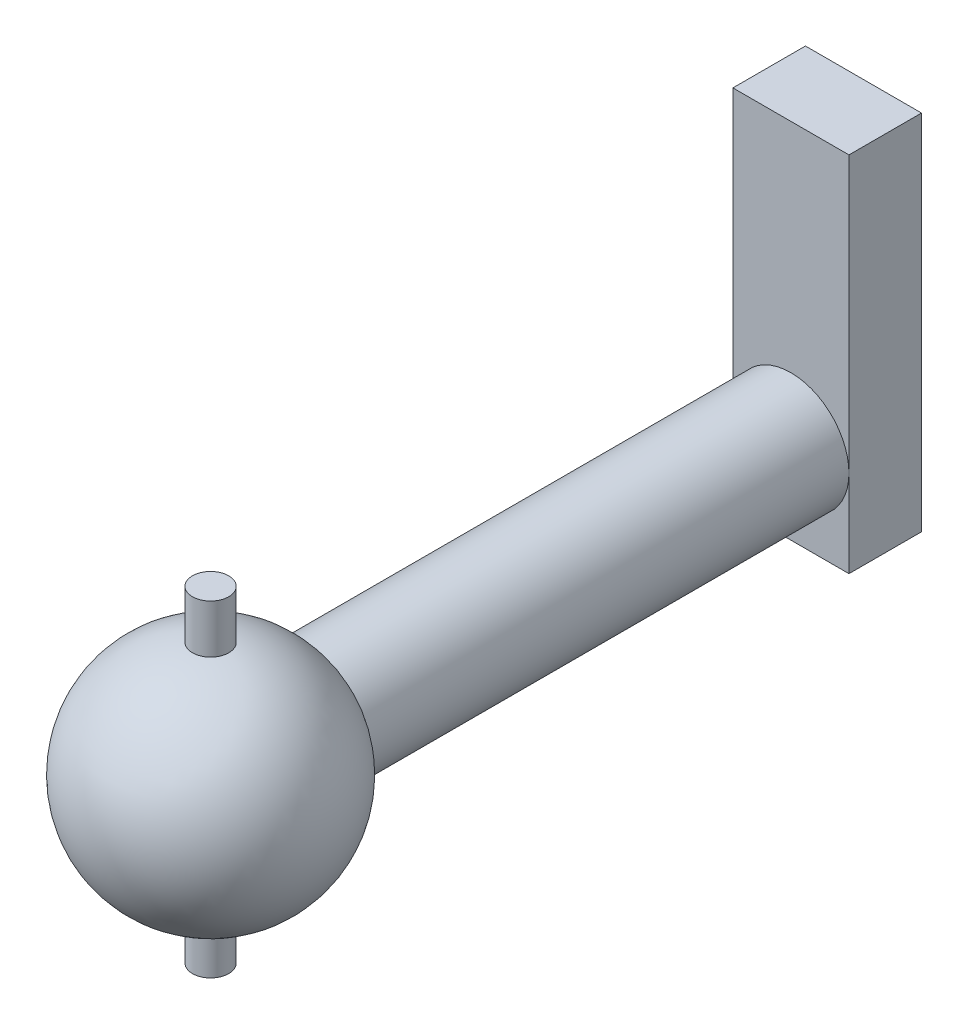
ISO-10303-21;
HEADER;
FILE_DESCRIPTION(('STEP AP214'),'2;1');
FILE_NAME('part.step','',(''),(''),'','','');
FILE_SCHEMA(('AUTOMOTIVE_DESIGN { 1 0 10303 214 1 1 1 1 }'));
ENDSEC;
DATA;
#1=APPLICATION_CONTEXT('core data for automotive mechanical design processes');
#2=APPLICATION_PROTOCOL_DEFINITION('international standard','automotive_design',2000,#1);
#3=PRODUCT_CONTEXT('',#1,'mechanical');
#4=PRODUCT('Part','Part','',(#3));
#5=PRODUCT_RELATED_PRODUCT_CATEGORY('part','',(#4));
#6=PRODUCT_DEFINITION_FORMATION('','',#4);
#7=PRODUCT_DEFINITION_CONTEXT('part definition',#1,'design');
#8=PRODUCT_DEFINITION('design','',#6,#7);
#9=PRODUCT_DEFINITION_SHAPE('','',#8);
#10=(LENGTH_UNIT() NAMED_UNIT(*) SI_UNIT(.MILLI.,.METRE.));
#11=(NAMED_UNIT(*) PLANE_ANGLE_UNIT() SI_UNIT($,.RADIAN.));
#12=(NAMED_UNIT(*) SI_UNIT($,.STERADIAN.) SOLID_ANGLE_UNIT());
#13=UNCERTAINTY_MEASURE_WITH_UNIT(LENGTH_MEASURE(1.E-05),#10,'distance_accuracy_value','');
#14=(GEOMETRIC_REPRESENTATION_CONTEXT(3) GLOBAL_UNCERTAINTY_ASSIGNED_CONTEXT((#13)) GLOBAL_UNIT_ASSIGNED_CONTEXT((#10,
#11,#12)) REPRESENTATION_CONTEXT('',''));
#15=CARTESIAN_POINT('',(0.,0.,0.));
#16=DIRECTION('',(0.,0.,1.));
#17=DIRECTION('',(1.,0.,0.));
#18=AXIS2_PLACEMENT_3D('',#15,#16,#17);
#19=CARTESIAN_POINT('',(0.,0.,80.));
#20=DIRECTION('',(0.,1.,0.));
#21=DIRECTION('',(1.,0.,0.));
#22=AXIS2_PLACEMENT_3D('',#19,#20,#21);
#23=SPHERICAL_SURFACE('',#22,16.);
#24=CARTESIAN_POINT('',(0.,15.8034806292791,80.));
#25=DIRECTION('',(0.,-1.,0.));
#26=DIRECTION('',(0.,0.,-1.));
#27=AXIS2_PLACEMENT_3D('',#24,#25,#26);
#28=CIRCLE('',#27,2.5);
#29=CARTESIAN_POINT('',(0.,15.8034806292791,77.5));
#30=VERTEX_POINT('',#29);
#31=EDGE_CURVE('E41',#30,#30,#28,.F.);
#32=ORIENTED_EDGE('',*,*,#31,.F.);
#33=EDGE_LOOP('',(#32));
#34=FACE_BOUND('',#33,.T.);
#35=CARTESIAN_POINT('',(0.,0.,66.143593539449));
#36=DIRECTION('',(0.,0.,1.));
#37=DIRECTION('',(1.,0.,0.));
#38=AXIS2_PLACEMENT_3D('',#35,#36,#37);
#39=CIRCLE('',#38,8.);
#40=CARTESIAN_POINT('',(8.,0.,66.143593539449));
#41=VERTEX_POINT('',#40);
#42=EDGE_CURVE('E112',#41,#41,#39,.T.);
#43=ORIENTED_EDGE('',*,*,#42,.T.);
#44=EDGE_LOOP('',(#43));
#45=FACE_BOUND('',#44,.T.);
#46=CARTESIAN_POINT('',(0.,-15.8034806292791,80.));
#47=DIRECTION('',(0.,1.,0.));
#48=DIRECTION('',(0.,0.,1.));
#49=AXIS2_PLACEMENT_3D('',#46,#47,#48);
#50=CIRCLE('',#49,2.5);
#51=CARTESIAN_POINT('',(0.,-15.8034806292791,77.5));
#52=VERTEX_POINT('',#51);
#53=EDGE_CURVE('E11',#52,#52,#50,.F.);
#54=ORIENTED_EDGE('',*,*,#53,.F.);
#55=EDGE_LOOP('',(#54));
#56=FACE_BOUND('',#55,.T.);
#57=ADVANCED_FACE('F33',(#34,#45,#56),#23,.T.);
#58=CARTESIAN_POINT('',(0.,0.,80.));
#59=DIRECTION('',(0.,0.,-1.));
#60=DIRECTION('',(-1.,0.,0.));
#61=AXIS2_PLACEMENT_3D('',#58,#59,#60);
#62=CYLINDRICAL_SURFACE('',#61,8.);
#63=CARTESIAN_POINT('',(0.,0.,0.));
#64=DIRECTION('',(0.,0.,1.));
#65=DIRECTION('',(1.,0.,0.));
#66=AXIS2_PLACEMENT_3D('',#63,#64,#65);
#67=CIRCLE('',#66,8.);
#68=CARTESIAN_POINT('',(8.,0.,0.));
#69=VERTEX_POINT('',#68);
#70=CARTESIAN_POINT('',(-8.,0.,0.));
#71=VERTEX_POINT('',#70);
#72=EDGE_CURVE('E105',#69,#71,#67,.T.);
#73=ORIENTED_EDGE('',*,*,#72,.T.);
#74=EDGE_CURVE('E55',#71,#69,#67,.T.);
#75=ORIENTED_EDGE('',*,*,#74,.T.);
#76=EDGE_LOOP('',(#73,#75));
#77=FACE_BOUND('',#76,.T.);
#78=ORIENTED_EDGE('',*,*,#42,.F.);
#79=EDGE_LOOP('',(#78));
#80=FACE_BOUND('',#79,.T.);
#81=ADVANCED_FACE('F35',(#77,#80),#62,.T.);
#82=CARTESIAN_POINT('',(8.,38.,0.));
#83=DIRECTION('',(0.,0.,1.));
#84=DIRECTION('',(1.,0.,0.));
#85=AXIS2_PLACEMENT_3D('',#82,#83,#84);
#86=PLANE('',#85);
#87=ORIENTED_EDGE('',*,*,#72,.F.);
#88=DIRECTION('',(0.,-1.,0.));
#89=VECTOR('',#88,1.);
#90=CARTESIAN_POINT('',(8.,-12.,0.));
#91=LINE('',#90,#89);
#92=CARTESIAN_POINT('',(8.,38.,0.));
#93=VERTEX_POINT('',#92);
#94=EDGE_CURVE('E48',#93,#69,#91,.T.);
#95=ORIENTED_EDGE('',*,*,#94,.F.);
#96=DIRECTION('',(1.,0.,0.));
#97=VECTOR('',#96,1.);
#98=CARTESIAN_POINT('',(8.,38.,0.));
#99=LINE('',#98,#97);
#100=CARTESIAN_POINT('',(-8.,38.,0.));
#101=VERTEX_POINT('',#100);
#102=EDGE_CURVE('E99',#101,#93,#99,.T.);
#103=ORIENTED_EDGE('',*,*,#102,.F.);
#104=DIRECTION('',(0.,1.,0.));
#105=VECTOR('',#104,1.);
#106=CARTESIAN_POINT('',(-8.,-12.,0.));
#107=LINE('',#106,#105);
#108=EDGE_CURVE('E225',#71,#101,#107,.T.);
#109=ORIENTED_EDGE('',*,*,#108,.F.);
#110=EDGE_LOOP('',(#87,#95,#103,#109));
#111=FACE_BOUND('',#110,.T.);
#112=ADVANCED_FACE('F145',(#111),#86,.T.);
#113=ORIENTED_EDGE('',*,*,#74,.F.);
#114=CARTESIAN_POINT('',(-8.,-12.,0.));
#115=VERTEX_POINT('',#114);
#116=EDGE_CURVE('E226',#115,#71,#107,.T.);
#117=ORIENTED_EDGE('',*,*,#116,.F.);
#118=DIRECTION('',(-1.,0.,0.));
#119=VECTOR('',#118,1.);
#120=CARTESIAN_POINT('',(8.,-12.,0.));
#121=LINE('',#120,#119);
#122=CARTESIAN_POINT('',(8.,-12.,0.));
#123=VERTEX_POINT('',#122);
#124=EDGE_CURVE('E223',#123,#115,#121,.T.);
#125=ORIENTED_EDGE('',*,*,#124,.F.);
#126=EDGE_CURVE('E102',#69,#123,#91,.T.);
#127=ORIENTED_EDGE('',*,*,#126,.F.);
#128=EDGE_LOOP('',(#113,#117,#125,#127));
#129=FACE_BOUND('',#128,.T.);
#130=ADVANCED_FACE('F148',(#129),#86,.T.);
#131=CARTESIAN_POINT('',(8.,-12.,-10.));
#132=DIRECTION('',(-1.,0.,0.));
#133=DIRECTION('',(0.,0.,1.));
#134=AXIS2_PLACEMENT_3D('',#131,#132,#133);
#135=PLANE('',#134);
#136=ORIENTED_EDGE('',*,*,#94,.T.);
#137=ORIENTED_EDGE('',*,*,#126,.T.);
#138=DIRECTION('',(0.,0.,1.));
#139=VECTOR('',#138,1.);
#140=CARTESIAN_POINT('',(8.,-12.,-10.));
#141=LINE('',#140,#139);
#142=CARTESIAN_POINT('',(8.,-12.,-10.));
#143=VERTEX_POINT('',#142);
#144=EDGE_CURVE('E86',#143,#123,#141,.T.);
#145=ORIENTED_EDGE('',*,*,#144,.F.);
#146=DIRECTION('',(0.,-1.,0.));
#147=VECTOR('',#146,1.);
#148=CARTESIAN_POINT('',(8.,-12.,-10.));
#149=LINE('',#148,#147);
#150=CARTESIAN_POINT('',(8.,38.,-10.));
#151=VERTEX_POINT('',#150);
#152=EDGE_CURVE('E92',#151,#143,#149,.T.);
#153=ORIENTED_EDGE('',*,*,#152,.F.);
#154=DIRECTION('',(0.,0.,1.));
#155=VECTOR('',#154,1.);
#156=CARTESIAN_POINT('',(8.,38.,-10.));
#157=LINE('',#156,#155);
#158=EDGE_CURVE('E221',#151,#93,#157,.T.);
#159=ORIENTED_EDGE('',*,*,#158,.T.);
#160=EDGE_LOOP('',(#136,#137,#145,#153,#159));
#161=FACE_BOUND('',#160,.T.);
#162=ADVANCED_FACE('F101',(#161),#135,.F.);
#163=CARTESIAN_POINT('',(8.,-12.,-10.));
#164=DIRECTION('',(0.,1.,0.));
#165=DIRECTION('',(0.,0.,1.));
#166=AXIS2_PLACEMENT_3D('',#163,#164,#165);
#167=PLANE('',#166);
#168=ORIENTED_EDGE('',*,*,#124,.T.);
#169=DIRECTION('',(0.,0.,1.));
#170=VECTOR('',#169,1.);
#171=CARTESIAN_POINT('',(-8.,-12.,-10.));
#172=LINE('',#171,#170);
#173=CARTESIAN_POINT('',(-8.,-12.,-10.));
#174=VERTEX_POINT('',#173);
#175=EDGE_CURVE('E88',#174,#115,#172,.T.);
#176=ORIENTED_EDGE('',*,*,#175,.F.);
#177=DIRECTION('',(-1.,0.,0.));
#178=VECTOR('',#177,1.);
#179=CARTESIAN_POINT('',(8.,-12.,-10.));
#180=LINE('',#179,#178);
#181=EDGE_CURVE('E82',#143,#174,#180,.T.);
#182=ORIENTED_EDGE('',*,*,#181,.F.);
#183=ORIENTED_EDGE('',*,*,#144,.T.);
#184=EDGE_LOOP('',(#168,#176,#182,#183));
#185=FACE_BOUND('',#184,.T.);
#186=ADVANCED_FACE('F84',(#185),#167,.F.);
#187=CARTESIAN_POINT('',(-8.,-12.,-10.));
#188=DIRECTION('',(1.,0.,0.));
#189=DIRECTION('',(0.,0.,-1.));
#190=AXIS2_PLACEMENT_3D('',#187,#188,#189);
#191=PLANE('',#190);
#192=ORIENTED_EDGE('',*,*,#116,.T.);
#193=ORIENTED_EDGE('',*,*,#108,.T.);
#194=DIRECTION('',(0.,0.,1.));
#195=VECTOR('',#194,1.);
#196=CARTESIAN_POINT('',(-8.,38.,-10.));
#197=LINE('',#196,#195);
#198=CARTESIAN_POINT('',(-8.,38.,-10.));
#199=VERTEX_POINT('',#198);
#200=EDGE_CURVE('E107',#199,#101,#197,.T.);
#201=ORIENTED_EDGE('',*,*,#200,.F.);
#202=DIRECTION('',(0.,1.,0.));
#203=VECTOR('',#202,1.);
#204=CARTESIAN_POINT('',(-8.,-12.,-10.));
#205=LINE('',#204,#203);
#206=EDGE_CURVE('E91',#174,#199,#205,.T.);
#207=ORIENTED_EDGE('',*,*,#206,.F.);
#208=ORIENTED_EDGE('',*,*,#175,.T.);
#209=EDGE_LOOP('',(#192,#193,#201,#207,#208));
#210=FACE_BOUND('',#209,.T.);
#211=ADVANCED_FACE('F152',(#210),#191,.F.);
#212=CARTESIAN_POINT('',(8.,38.,-10.));
#213=DIRECTION('',(0.,-1.,0.));
#214=DIRECTION('',(0.,0.,-1.));
#215=AXIS2_PLACEMENT_3D('',#212,#213,#214);
#216=PLANE('',#215);
#217=ORIENTED_EDGE('',*,*,#102,.T.);
#218=ORIENTED_EDGE('',*,*,#158,.F.);
#219=DIRECTION('',(1.,0.,0.));
#220=VECTOR('',#219,1.);
#221=CARTESIAN_POINT('',(8.,38.,-10.));
#222=LINE('',#221,#220);
#223=EDGE_CURVE('E97',#199,#151,#222,.T.);
#224=ORIENTED_EDGE('',*,*,#223,.F.);
#225=ORIENTED_EDGE('',*,*,#200,.T.);
#226=EDGE_LOOP('',(#217,#218,#224,#225));
#227=FACE_BOUND('',#226,.T.);
#228=ADVANCED_FACE('F144',(#227),#216,.F.);
#229=CARTESIAN_POINT('',(8.,38.,-10.));
#230=DIRECTION('',(0.,0.,1.));
#231=DIRECTION('',(1.,0.,0.));
#232=AXIS2_PLACEMENT_3D('',#229,#230,#231);
#233=PLANE('',#232);
#234=ORIENTED_EDGE('',*,*,#152,.T.);
#235=ORIENTED_EDGE('',*,*,#181,.T.);
#236=ORIENTED_EDGE('',*,*,#206,.T.);
#237=ORIENTED_EDGE('',*,*,#223,.T.);
#238=EDGE_LOOP('',(#234,#235,#236,#237));
#239=FACE_BOUND('',#238,.T.);
#240=ADVANCED_FACE('F95',(#239),#233,.F.);
#241=CARTESIAN_POINT('',(0.,22.5,80.));
#242=DIRECTION('',(0.,1.,0.));
#243=DIRECTION('',(0.,0.,1.));
#244=AXIS2_PLACEMENT_3D('',#241,#242,#243);
#245=PLANE('',#244);
#246=CARTESIAN_POINT('',(0.,22.5,80.));
#247=DIRECTION('',(0.,1.,0.));
#248=DIRECTION('',(0.,0.,1.));
#249=AXIS2_PLACEMENT_3D('',#246,#247,#248);
#250=CIRCLE('',#249,2.5);
#251=CARTESIAN_POINT('',(0.,22.5,77.5));
#252=VERTEX_POINT('',#251);
#253=EDGE_CURVE('E214',#252,#252,#250,.T.);
#254=ORIENTED_EDGE('',*,*,#253,.T.);
#255=EDGE_LOOP('',(#254));
#256=FACE_BOUND('',#255,.T.);
#257=ADVANCED_FACE('F137',(#256),#245,.T.);
#258=CARTESIAN_POINT('',(0.,22.5,80.));
#259=DIRECTION('',(0.,-1.,0.));
#260=DIRECTION('',(0.,0.,-1.));
#261=AXIS2_PLACEMENT_3D('',#258,#259,#260);
#262=CYLINDRICAL_SURFACE('',#261,2.5);
#263=CARTESIAN_POINT('',(0.,22.5,77.5));
#264=CARTESIAN_POINT('',(0.,22.4302445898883,77.5));
#265=CARTESIAN_POINT('',(0.,22.3604891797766,77.5));
#266=CARTESIAN_POINT('',(0.,22.2209783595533,77.5));
#267=CARTESIAN_POINT('',(0.,22.1512229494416,77.5));
#268=CARTESIAN_POINT('',(0.,22.0117121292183,77.5));
#269=CARTESIAN_POINT('',(0.,21.9419567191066,77.5));
#270=CARTESIAN_POINT('',(0.,21.8024458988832,77.5));
#271=CARTESIAN_POINT('',(0.,21.7326904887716,77.5));
#272=CARTESIAN_POINT('',(0.,21.5931796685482,77.5));
#273=CARTESIAN_POINT('',(0.,21.5234242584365,77.5));
#274=CARTESIAN_POINT('',(0.,21.3839134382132,77.5));
#275=CARTESIAN_POINT('',(0.,21.3141580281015,77.5));
#276=CARTESIAN_POINT('',(0.,21.1746472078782,77.5));
#277=CARTESIAN_POINT('',(0.,21.1048917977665,77.5));
#278=CARTESIAN_POINT('',(0.,20.9653809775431,77.5));
#279=CARTESIAN_POINT('',(0.,20.8956255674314,77.5));
#280=CARTESIAN_POINT('',(0.,20.7561147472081,77.5));
#281=CARTESIAN_POINT('',(0.,20.6863593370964,77.5));
#282=CARTESIAN_POINT('',(0.,20.5468485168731,77.5));
#283=CARTESIAN_POINT('',(0.,20.4770931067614,77.5));
#284=CARTESIAN_POINT('',(0.,20.337582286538,77.5));
#285=CARTESIAN_POINT('',(0.,20.2678268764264,77.5));
#286=CARTESIAN_POINT('',(0.,20.128316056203,77.5));
#287=CARTESIAN_POINT('',(0.,20.0585606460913,77.5));
#288=CARTESIAN_POINT('',(0.,19.919049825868,77.5));
#289=CARTESIAN_POINT('',(0.,19.8492944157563,77.5));
#290=CARTESIAN_POINT('',(0.,19.709783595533,77.5));
#291=CARTESIAN_POINT('',(0.,19.6400281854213,77.5));
#292=CARTESIAN_POINT('',(0.,19.5005173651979,77.5));
#293=CARTESIAN_POINT('',(0.,19.4307619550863,77.5));
#294=CARTESIAN_POINT('',(0.,19.2912511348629,77.5));
#295=CARTESIAN_POINT('',(0.,19.2214957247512,77.5));
#296=CARTESIAN_POINT('',(0.,19.0819849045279,77.5));
#297=CARTESIAN_POINT('',(0.,19.0122294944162,77.5));
#298=CARTESIAN_POINT('',(0.,18.8727186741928,77.5));
#299=CARTESIAN_POINT('',(0.,18.8029632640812,77.5));
#300=CARTESIAN_POINT('',(0.,18.6634524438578,77.5));
#301=CARTESIAN_POINT('',(0.,18.5936970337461,77.5));
#302=CARTESIAN_POINT('',(0.,18.4541862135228,77.5));
#303=CARTESIAN_POINT('',(0.,18.3844308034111,77.5));
#304=CARTESIAN_POINT('',(0.,18.2449199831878,77.5));
#305=CARTESIAN_POINT('',(0.,18.1751645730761,77.5));
#306=CARTESIAN_POINT('',(0.,18.0356537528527,77.5));
#307=CARTESIAN_POINT('',(0.,17.9658983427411,77.5));
#308=CARTESIAN_POINT('',(0.,17.8263875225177,77.5));
#309=CARTESIAN_POINT('',(0.,17.756632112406,77.5));
#310=CARTESIAN_POINT('',(0.,17.6171212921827,77.5));
#311=CARTESIAN_POINT('',(0.,17.547365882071,77.5));
#312=CARTESIAN_POINT('',(0.,17.4078550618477,77.5));
#313=CARTESIAN_POINT('',(0.,17.338099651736,77.5));
#314=CARTESIAN_POINT('',(0.,17.1985888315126,77.5));
#315=CARTESIAN_POINT('',(0.,17.128833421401,77.5));
#316=CARTESIAN_POINT('',(0.,16.9893226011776,77.5));
#317=CARTESIAN_POINT('',(0.,16.9195671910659,77.5));
#318=CARTESIAN_POINT('',(0.,16.7800563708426,77.5));
#319=CARTESIAN_POINT('',(0.,16.7103009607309,77.5));
#320=CARTESIAN_POINT('',(0.,16.5707901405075,77.5));
#321=CARTESIAN_POINT('',(0.,16.5010347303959,77.5));
#322=CARTESIAN_POINT('',(0.,16.3615239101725,77.5));
#323=CARTESIAN_POINT('',(0.,16.2917685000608,77.5));
#324=CARTESIAN_POINT('',(0.,16.1522576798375,77.5));
#325=CARTESIAN_POINT('',(0.,16.0825022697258,77.5));
#326=CARTESIAN_POINT('',(0.,15.9429914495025,77.5));
#327=CARTESIAN_POINT('',(0.,15.8732360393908,77.5));
#328=CARTESIAN_POINT('',(0.,15.8034806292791,77.5));
#329=B_SPLINE_CURVE_WITH_KNOTS('',3,(#263,#264,#265,#266,#267,#268,#269,#270,#271,#272,#273,
#274,#275,#276,#277,#278,#279,#280,#281,#282,#283,#284,#285,#286,#287,#288,#289,#290,#291,#292,
#293,#294,#295,#296,#297,#298,#299,#300,#301,#302,#303,#304,#305,#306,#307,#308,#309,#310,#311,
#312,#313,#314,#315,#316,#317,#318,#319,#320,#321,#322,#323,#324,#325,#326,#327,#328),
.UNSPECIFIED.,.F.,.F.,(4,2,2,2,2,2,2,2,2,2,2,2,2,2,2,2,2,2,2,2,2,2,2,2,2,2,2,2,2,2,2,2,4),(0.,
0.209266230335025,0.418532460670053,0.627798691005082,0.83706492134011,1.04633115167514,
1.25559738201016,1.46486361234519,1.67412984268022,1.88339607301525,2.09266230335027,
2.3019285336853,2.51119476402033,2.72046099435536,2.92972722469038,3.13899345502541,
3.34825968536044,3.55752591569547,3.76679214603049,3.97605837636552,4.18532460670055,
4.39459083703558,4.60385706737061,4.81312329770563,5.02238952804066,5.23165575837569,
5.44092198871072,5.65018821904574,5.85945444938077,6.0687206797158,6.27798691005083,
6.48725314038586,6.69651937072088),.UNSPECIFIED.);
#330=EDGE_CURVE('BSEAM117',#252,#30,#329,.T.);
#331=ORIENTED_EDGE('',*,*,#253,.F.);
#332=ORIENTED_EDGE('',*,*,#31,.T.);
#333=ORIENTED_EDGE('',*,*,#330,.T.);
#334=ORIENTED_EDGE('',*,*,#330,.F.);
#335=EDGE_LOOP('',(#331,#333,#332,#334));
#336=FACE_BOUND('',#335,.T.);
#337=ADVANCED_FACE('F117',(#336),#262,.T.);
#338=CARTESIAN_POINT('',(0.,-22.5,80.));
#339=DIRECTION('',(0.,1.,0.));
#340=DIRECTION('',(0.,0.,1.));
#341=AXIS2_PLACEMENT_3D('',#338,#339,#340);
#342=CIRCLE('',#341,2.5);
#343=CARTESIAN_POINT('',(0.,-22.5,77.5));
#344=VERTEX_POINT('',#343);
#345=EDGE_CURVE('E215',#344,#344,#342,.T.);
#346=CARTESIAN_POINT('',(0.,-22.5,77.5));
#347=CARTESIAN_POINT('',(0.,-22.4302445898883,77.5));
#348=CARTESIAN_POINT('',(0.,-22.3604891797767,77.5));
#349=CARTESIAN_POINT('',(0.,-22.2209783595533,77.5));
#350=CARTESIAN_POINT('',(0.,-22.1512229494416,77.5));
#351=CARTESIAN_POINT('',(0.,-22.0117121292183,77.5));
#352=CARTESIAN_POINT('',(0.,-21.9419567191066,77.5));
#353=CARTESIAN_POINT('',(0.,-21.8024458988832,77.5));
#354=CARTESIAN_POINT('',(0.,-21.7326904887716,77.5));
#355=CARTESIAN_POINT('',(0.,-21.5931796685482,77.5));
#356=CARTESIAN_POINT('',(0.,-21.5234242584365,77.5));
#357=CARTESIAN_POINT('',(0.,-21.3839134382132,77.5));
#358=CARTESIAN_POINT('',(0.,-21.3141580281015,77.5));
#359=CARTESIAN_POINT('',(0.,-21.1746472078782,77.5));
#360=CARTESIAN_POINT('',(0.,-21.1048917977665,77.5));
#361=CARTESIAN_POINT('',(0.,-20.9653809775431,77.5));
#362=CARTESIAN_POINT('',(0.,-20.8956255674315,77.5));
#363=CARTESIAN_POINT('',(0.,-20.7561147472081,77.5));
#364=CARTESIAN_POINT('',(0.,-20.6863593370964,77.5));
#365=CARTESIAN_POINT('',(0.,-20.5468485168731,77.5));
#366=CARTESIAN_POINT('',(0.,-20.4770931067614,77.5));
#367=CARTESIAN_POINT('',(0.,-20.337582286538,77.5));
#368=CARTESIAN_POINT('',(0.,-20.2678268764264,77.5));
#369=CARTESIAN_POINT('',(0.,-20.128316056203,77.5));
#370=CARTESIAN_POINT('',(0.,-20.0585606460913,77.5));
#371=CARTESIAN_POINT('',(0.,-19.919049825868,77.5));
#372=CARTESIAN_POINT('',(0.,-19.8492944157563,77.5));
#373=CARTESIAN_POINT('',(0.,-19.709783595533,77.5));
#374=CARTESIAN_POINT('',(0.,-19.6400281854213,77.5));
#375=CARTESIAN_POINT('',(0.,-19.5005173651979,77.5));
#376=CARTESIAN_POINT('',(0.,-19.4307619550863,77.5));
#377=CARTESIAN_POINT('',(0.,-19.2912511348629,77.5));
#378=CARTESIAN_POINT('',(0.,-19.2214957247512,77.5));
#379=CARTESIAN_POINT('',(0.,-19.0819849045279,77.5));
#380=CARTESIAN_POINT('',(0.,-19.0122294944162,77.5));
#381=CARTESIAN_POINT('',(0.,-18.8727186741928,77.5));
#382=CARTESIAN_POINT('',(0.,-18.8029632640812,77.5));
#383=CARTESIAN_POINT('',(0.,-18.6634524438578,77.5));
#384=CARTESIAN_POINT('',(0.,-18.5936970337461,77.5));
#385=CARTESIAN_POINT('',(0.,-18.4541862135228,77.5));
#386=CARTESIAN_POINT('',(0.,-18.3844308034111,77.5));
#387=CARTESIAN_POINT('',(0.,-18.2449199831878,77.5));
#388=CARTESIAN_POINT('',(0.,-18.1751645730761,77.5));
#389=CARTESIAN_POINT('',(0.,-18.0356537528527,77.5));
#390=CARTESIAN_POINT('',(0.,-17.9658983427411,77.5));
#391=CARTESIAN_POINT('',(0.,-17.8263875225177,77.5));
#392=CARTESIAN_POINT('',(0.,-17.756632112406,77.5));
#393=CARTESIAN_POINT('',(0.,-17.6171212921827,77.5));
#394=CARTESIAN_POINT('',(0.,-17.547365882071,77.5));
#395=CARTESIAN_POINT('',(0.,-17.4078550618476,77.5));
#396=CARTESIAN_POINT('',(0.,-17.338099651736,77.5));
#397=CARTESIAN_POINT('',(0.,-17.1985888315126,77.5));
#398=CARTESIAN_POINT('',(0.,-17.1288334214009,77.5));
#399=CARTESIAN_POINT('',(0.,-16.9893226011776,77.5));
#400=CARTESIAN_POINT('',(0.,-16.9195671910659,77.5));
#401=CARTESIAN_POINT('',(0.,-16.7800563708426,77.5));
#402=CARTESIAN_POINT('',(0.,-16.7103009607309,77.5));
#403=CARTESIAN_POINT('',(0.,-16.5707901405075,77.5));
#404=CARTESIAN_POINT('',(0.,-16.5010347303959,77.5));
#405=CARTESIAN_POINT('',(0.,-16.3615239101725,77.5));
#406=CARTESIAN_POINT('',(0.,-16.2917685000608,77.5));
#407=CARTESIAN_POINT('',(0.,-16.1522576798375,77.5));
#408=CARTESIAN_POINT('',(0.,-16.0825022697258,77.5));
#409=CARTESIAN_POINT('',(0.,-15.9429914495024,77.5));
#410=CARTESIAN_POINT('',(0.,-15.8732360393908,77.5));
#411=CARTESIAN_POINT('',(0.,-15.8034806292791,77.5));
#412=B_SPLINE_CURVE_WITH_KNOTS('',3,(#346,#347,#348,#349,#350,#351,#352,#353,#354,#355,#356,
#357,#358,#359,#360,#361,#362,#363,#364,#365,#366,#367,#368,#369,#370,#371,#372,#373,#374,#375,
#376,#377,#378,#379,#380,#381,#382,#383,#384,#385,#386,#387,#388,#389,#390,#391,#392,#393,#394,
#395,#396,#397,#398,#399,#400,#401,#402,#403,#404,#405,#406,#407,#408,#409,#410,#411),
.UNSPECIFIED.,.F.,.F.,(4,2,2,2,2,2,2,2,2,2,2,2,2,2,2,2,2,2,2,2,2,2,2,2,2,2,2,2,2,2,2,2,4),(0.,
0.209266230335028,0.418532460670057,0.627798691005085,0.837064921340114,1.04633115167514,
1.25559738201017,1.4648636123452,1.67412984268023,1.88339607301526,2.09266230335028,
2.30192853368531,2.51119476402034,2.72046099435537,2.9297272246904,3.13899345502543,
3.34825968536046,3.55752591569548,3.76679214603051,3.97605837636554,4.18532460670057,
4.3945908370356,4.60385706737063,4.81312329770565,5.02238952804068,5.23165575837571,
5.44092198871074,5.65018821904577,5.8594544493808,6.06872067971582,6.27798691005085,
6.48725314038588,6.69651937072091),.UNSPECIFIED.);
#413=EDGE_CURVE('BSEAM126',#344,#52,#412,.T.);
#414=ORIENTED_EDGE('',*,*,#345,.T.);
#415=ORIENTED_EDGE('',*,*,#53,.T.);
#416=ORIENTED_EDGE('',*,*,#413,.T.);
#417=ORIENTED_EDGE('',*,*,#413,.F.);
#418=EDGE_LOOP('',(#414,#416,#415,#417));
#419=FACE_BOUND('',#418,.T.);
#420=ADVANCED_FACE('F126',(#419),#262,.T.);
#421=CARTESIAN_POINT('',(0.,-22.5,80.));
#422=DIRECTION('',(0.,1.,0.));
#423=DIRECTION('',(0.,0.,1.));
#424=AXIS2_PLACEMENT_3D('',#421,#422,#423);
#425=PLANE('',#424);
#426=ORIENTED_EDGE('',*,*,#345,.F.);
#427=EDGE_LOOP('',(#426));
#428=FACE_BOUND('',#427,.T.);
#429=ADVANCED_FACE('F128',(#428),#425,.F.);
#430=CLOSED_SHELL('',(#57,#81,#112,#130,#162,#186,#211,#228,#240,#257,#337,#420,#429));
#431=MANIFOLD_SOLID_BREP('B2',#430);
#432=ADVANCED_BREP_SHAPE_REPRESENTATION('',(#18,#431),#14);
#433=SHAPE_DEFINITION_REPRESENTATION(#9,#432);
ENDSEC;
END-ISO-10303-21;
